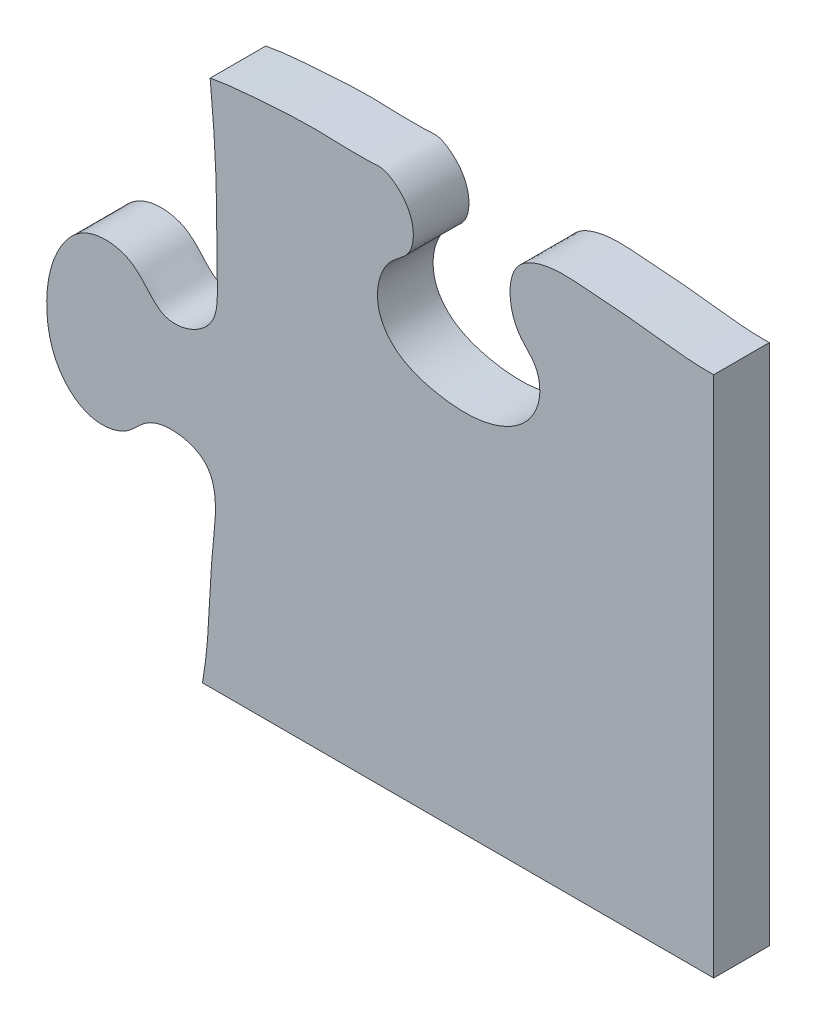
ISO-10303-21;
HEADER;
FILE_DESCRIPTION(('STEP AP214'),'2;1');
FILE_NAME('part.step','',(''),(''),'','','');
FILE_SCHEMA(('AUTOMOTIVE_DESIGN { 1 0 10303 214 1 1 1 1 }'));
ENDSEC;
DATA;
#1=APPLICATION_CONTEXT('core data for automotive mechanical design processes');
#2=APPLICATION_PROTOCOL_DEFINITION('international standard','automotive_design',2000,#1);
#3=PRODUCT_CONTEXT('',#1,'mechanical');
#4=PRODUCT('Part','Part','',(#3));
#5=PRODUCT_RELATED_PRODUCT_CATEGORY('part','',(#4));
#6=PRODUCT_DEFINITION_FORMATION('','',#4);
#7=PRODUCT_DEFINITION_CONTEXT('part definition',#1,'design');
#8=PRODUCT_DEFINITION('design','',#6,#7);
#9=PRODUCT_DEFINITION_SHAPE('','',#8);
#10=(LENGTH_UNIT() NAMED_UNIT(*) SI_UNIT(.MILLI.,.METRE.));
#11=(NAMED_UNIT(*) PLANE_ANGLE_UNIT() SI_UNIT($,.RADIAN.));
#12=(NAMED_UNIT(*) SI_UNIT($,.STERADIAN.) SOLID_ANGLE_UNIT());
#13=UNCERTAINTY_MEASURE_WITH_UNIT(LENGTH_MEASURE(1.E-05),#10,'distance_accuracy_value','');
#14=(GEOMETRIC_REPRESENTATION_CONTEXT(3) GLOBAL_UNCERTAINTY_ASSIGNED_CONTEXT((#13)) GLOBAL_UNIT_ASSIGNED_CONTEXT((#10,
#11,#12)) REPRESENTATION_CONTEXT('',''));
#15=CARTESIAN_POINT('',(0.,0.,0.));
#16=DIRECTION('',(0.,0.,1.));
#17=DIRECTION('',(1.,0.,0.));
#18=AXIS2_PLACEMENT_3D('',#15,#16,#17);
#19=CARTESIAN_POINT('',(325.257058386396,356.,-0.00999999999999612));
#20=CARTESIAN_POINT('',(320.961162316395,345.029410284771,-0.00999999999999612));
#21=CARTESIAN_POINT('',(320.821863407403,330.111228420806,-0.00999999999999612));
#22=CARTESIAN_POINT('',(317.746642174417,310.708405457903,-0.00999999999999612));
#23=CARTESIAN_POINT('',(324.80874526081,302.068845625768,-0.00999999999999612));
#24=CARTESIAN_POINT('',(334.47949844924,301.092198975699,-0.00999999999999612));
#25=CARTESIAN_POINT('',(341.199385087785,308.405018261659,-0.00999999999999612));
#26=CARTESIAN_POINT('',(351.88918877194,310.104343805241,-0.00999999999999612));
#27=CARTESIAN_POINT('',(365.477229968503,308.551893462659,-0.00999999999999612));
#28=CARTESIAN_POINT('',(373.973100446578,293.452904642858,-0.00999999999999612));
#29=CARTESIAN_POINT('',(374.68177629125,275.222888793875,-0.00999999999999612));
#30=CARTESIAN_POINT('',(363.969524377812,260.217712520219,-0.00999999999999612));
#31=CARTESIAN_POINT('',(347.560929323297,258.00994019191,-0.00999999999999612));
#32=CARTESIAN_POINT('',(341.667769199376,269.318092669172,-0.00999999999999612));
#33=CARTESIAN_POINT('',(329.050646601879,268.591464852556,-0.00999999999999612));
#34=CARTESIAN_POINT('',(320.333215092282,258.695380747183,-0.00999999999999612));
#35=CARTESIAN_POINT('',(321.071783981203,237.536716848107,-0.00999999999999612));
#36=CARTESIAN_POINT('',(324.445641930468,214.63289279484,-0.00999999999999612));
#37=CARTESIAN_POINT('',(329.382935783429,185.164436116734,-0.00999999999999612));
#38=CARTESIAN_POINT('',(327.148862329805,151.381238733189,-0.00999999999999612));
#39=CARTESIAN_POINT('',(325.104399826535,122.782989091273,-0.00999999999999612));
#40=CARTESIAN_POINT('',(327.870971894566,95.9027200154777,-0.00999999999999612));
#41=CARTESIAN_POINT('',(342.142457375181,93.3383677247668,-0.00999999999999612));
#42=CARTESIAN_POINT('',(347.900573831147,101.981576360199,-0.00999999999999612));
#43=CARTESIAN_POINT('',(356.834615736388,107.765098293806,-0.00999999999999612));
#44=CARTESIAN_POINT('',(369.379527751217,108.600772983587,-0.00999999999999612));
#45=CARTESIAN_POINT('',(380.120269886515,95.9775166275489,-0.00999999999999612));
#46=CARTESIAN_POINT('',(380.578851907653,78.7451628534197,-0.00999999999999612));
#47=CARTESIAN_POINT('',(375.610818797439,61.7248962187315,-0.00999999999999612));
#48=CARTESIAN_POINT('',(363.715824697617,52.8157722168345,-0.00999999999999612));
#49=CARTESIAN_POINT('',(349.85984979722,55.1705340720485,-0.00999999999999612));
#50=CARTESIAN_POINT('',(346.945856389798,64.810819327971,-0.00999999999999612));
#51=CARTESIAN_POINT('',(338.689797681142,70.9897723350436,-0.00999999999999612));
#52=CARTESIAN_POINT('',(330.580353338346,62.4728514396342,-0.00999999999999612));
#53=CARTESIAN_POINT('',(328.928359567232,48.4436203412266,-0.00999999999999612));
#54=CARTESIAN_POINT('',(329.318852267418,30.6791591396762,-0.00999999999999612));
#55=CARTESIAN_POINT('',(330.266196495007,6.75725364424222,-0.00999999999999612));
#56=CARTESIAN_POINT('',(328.413221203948,-22.8156731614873,-0.00999999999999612));
#57=CARTESIAN_POINT('',(325.957403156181,-47.4645191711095,-0.00999999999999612));
#58=CARTESIAN_POINT('',(324.284943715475,-71.7282942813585,-0.00999999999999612));
#59=CARTESIAN_POINT('',(336.158184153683,-74.5800053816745,-0.00999999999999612));
#60=CARTESIAN_POINT('',(345.605596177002,-70.2479425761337,-0.00999999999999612));
#61=CARTESIAN_POINT('',(352.349142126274,-60.6528291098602,-0.00999999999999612));
#62=CARTESIAN_POINT('',(364.054661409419,-61.084248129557,-0.00999999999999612));
#63=CARTESIAN_POINT('',(376.894401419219,-65.7171784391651,-0.00999999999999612));
#64=CARTESIAN_POINT('',(383.833690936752,-81.7570856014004,-0.00999999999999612));
#65=CARTESIAN_POINT('',(380.385627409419,-99.5380411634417,-0.00999999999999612));
#66=CARTESIAN_POINT('',(369.163029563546,-108.064440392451,-0.00999999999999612));
#67=CARTESIAN_POINT('',(355.487733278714,-112.894616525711,-0.00999999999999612));
#68=CARTESIAN_POINT('',(345.56890588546,-106.804716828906,-0.00999999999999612));
#69=CARTESIAN_POINT('',(337.864154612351,-99.6791187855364,-0.00999999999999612));
#70=CARTESIAN_POINT('',(325.333875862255,-101.340144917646,-0.00999999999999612));
#71=CARTESIAN_POINT('',(326.442256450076,-127.027418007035,-0.00999999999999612));
#72=CARTESIAN_POINT('',(328.990782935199,-147.650339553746,-0.00999999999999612));
#73=CARTESIAN_POINT('',(331.889209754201,-175.720931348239,-0.00999999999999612));
#74=CARTESIAN_POINT('',(333.49389611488,-200.043501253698,-0.00999999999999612));
#75=CARTESIAN_POINT('',(333.062418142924,-222.75850264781,-0.00999999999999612));
#76=CARTESIAN_POINT('',(334.041200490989,-241.335918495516,-0.00999999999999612));
#77=CARTESIAN_POINT('',(324.292862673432,-248.82670983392,-0.00999999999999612));
#78=CARTESIAN_POINT('',(313.862264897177,-249.831348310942,-0.00999999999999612));
#79=CARTESIAN_POINT('',(308.055191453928,-242.821422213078,-0.00999999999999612));
#80=CARTESIAN_POINT('',(300.480173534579,-235.015509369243,-0.00999999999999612));
#81=CARTESIAN_POINT('',(285.021810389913,-234.387092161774,-0.00999999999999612));
#82=CARTESIAN_POINT('',(274.179995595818,-248.432983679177,-0.00999999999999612));
#83=CARTESIAN_POINT('',(270.871780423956,-265.971502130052,-0.00999999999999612));
#84=CARTESIAN_POINT('',(274.212392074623,-284.032454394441,-0.00999999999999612));
#85=CARTESIAN_POINT('',(287.225269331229,-295.05235393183,-0.00999999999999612));
#86=CARTESIAN_POINT('',(300.809811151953,-292.931473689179,-0.00999999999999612));
#87=CARTESIAN_POINT('',(307.364923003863,-284.321305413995,-0.00999999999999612));
#88=CARTESIAN_POINT('',(317.634904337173,-281.646810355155,-0.00999999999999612));
#89=CARTESIAN_POINT('',(335.194502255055,-286.515768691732,-0.00999999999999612));
#90=CARTESIAN_POINT('',(329.900008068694,-321.054322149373,-0.00999999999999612));
#91=CARTESIAN_POINT('',(330.939416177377,-339.80390498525,-0.00999999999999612));
#92=CARTESIAN_POINT('',(328.124742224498,-356.,-0.00999999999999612));
#93=B_SPLINE_CURVE_WITH_KNOTS('',3,(#19,#20,#21,#22,#23,#24,#25,#26,#27,#28,#29,#30,#31,#32,#33,
#34,#35,#36,#37,#38,#39,#40,#41,#42,#43,#44,#45,#46,#47,#48,#49,#50,#51,#52,#53,#54,#55,#56,#57,
#58,#59,#60,#61,#62,#63,#64,#65,#66,#67,#68,#69,#70,#71,#72,#73,#74,#75,#76,#77,#78,#79,#80,#81,
#82,#83,#84,#85,#86,#87,#88,#89,#90,#91,#92),.UNSPECIFIED.,.F.,.F.,(4,1,1,1,1,1,1,1,1,1,1,1,1,1,
1,1,1,1,1,1,1,1,1,1,1,1,1,1,1,1,1,1,1,1,1,1,1,1,1,1,1,1,1,1,1,1,1,1,1,1,1,1,1,1,1,1,1,1,1,1,1,1,
1,1,1,1,1,1,1,1,1,4),(0.,0.0294359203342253,0.0410015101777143,0.0482578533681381,
0.056156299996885,0.0628725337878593,0.0726761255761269,0.0834491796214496,0.0961628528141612,
0.113582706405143,0.1292026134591,0.140393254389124,0.149299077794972,0.1578234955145,
0.168702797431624,0.18034067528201,0.211171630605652,0.230177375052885,0.258218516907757,
0.297936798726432,0.310855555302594,0.319545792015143,0.327782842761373,0.335750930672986,
0.347377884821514,0.35651553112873,0.375682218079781,0.389966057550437,0.401463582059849,
0.411615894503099,0.420595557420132,0.426581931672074,0.43417370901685,0.444880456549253,
0.464136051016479,0.480140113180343,0.507902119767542,0.539252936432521,0.552990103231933,
0.558383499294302,0.567729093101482,0.578921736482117,0.586248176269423,0.596305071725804,
0.613504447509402,0.626237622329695,0.64117705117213,0.647978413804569,0.662971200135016,
0.667795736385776,0.675224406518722,0.689293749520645,0.721613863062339,0.73643728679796,
0.762019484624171,0.785031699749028,0.797726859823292,0.806664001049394,0.814473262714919,
0.822386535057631,0.828765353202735,0.842978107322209,0.855573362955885,0.871677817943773,
0.889062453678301,0.900888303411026,0.912516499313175,0.920249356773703,0.928039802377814,
0.939164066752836,0.961164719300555,1.),.UNSPECIFIED.);
#94=DIRECTION('',(0.,0.,1.));
#95=VECTOR('',#94,1.);
#96=SURFACE_OF_LINEAR_EXTRUSION('',#93,#95);
#97=CARTESIAN_POINT('',(325.257058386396,356.,20.));
#98=CARTESIAN_POINT('',(320.961162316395,345.029410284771,20.));
#99=CARTESIAN_POINT('',(320.821863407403,330.111228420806,20.));
#100=CARTESIAN_POINT('',(317.746642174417,310.708405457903,20.));
#101=CARTESIAN_POINT('',(324.80874526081,302.068845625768,20.));
#102=CARTESIAN_POINT('',(334.47949844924,301.092198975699,20.));
#103=CARTESIAN_POINT('',(341.199385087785,308.405018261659,20.));
#104=CARTESIAN_POINT('',(351.88918877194,310.104343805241,20.));
#105=CARTESIAN_POINT('',(365.477229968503,308.551893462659,20.));
#106=CARTESIAN_POINT('',(373.973100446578,293.452904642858,20.));
#107=CARTESIAN_POINT('',(374.68177629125,275.222888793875,20.));
#108=CARTESIAN_POINT('',(363.969524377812,260.217712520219,20.));
#109=CARTESIAN_POINT('',(347.560929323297,258.00994019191,20.));
#110=CARTESIAN_POINT('',(341.667769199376,269.318092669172,20.));
#111=CARTESIAN_POINT('',(329.050646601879,268.591464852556,20.));
#112=CARTESIAN_POINT('',(320.333215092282,258.695380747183,20.));
#113=CARTESIAN_POINT('',(321.071783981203,237.536716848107,20.));
#114=CARTESIAN_POINT('',(324.445641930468,214.63289279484,20.));
#115=CARTESIAN_POINT('',(329.382935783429,185.164436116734,20.));
#116=CARTESIAN_POINT('',(327.148862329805,151.381238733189,20.));
#117=CARTESIAN_POINT('',(325.104399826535,122.782989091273,20.));
#118=CARTESIAN_POINT('',(327.870971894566,95.9027200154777,20.));
#119=CARTESIAN_POINT('',(342.142457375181,93.3383677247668,20.));
#120=CARTESIAN_POINT('',(347.900573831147,101.981576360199,20.));
#121=CARTESIAN_POINT('',(356.834615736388,107.765098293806,20.));
#122=CARTESIAN_POINT('',(369.379527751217,108.600772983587,20.));
#123=CARTESIAN_POINT('',(380.120269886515,95.9775166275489,20.));
#124=CARTESIAN_POINT('',(380.578851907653,78.7451628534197,20.));
#125=CARTESIAN_POINT('',(375.610818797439,61.7248962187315,20.));
#126=CARTESIAN_POINT('',(363.715824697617,52.8157722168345,20.));
#127=CARTESIAN_POINT('',(349.85984979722,55.1705340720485,20.));
#128=CARTESIAN_POINT('',(346.945856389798,64.810819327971,20.));
#129=CARTESIAN_POINT('',(338.689797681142,70.9897723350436,20.));
#130=CARTESIAN_POINT('',(330.580353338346,62.4728514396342,20.));
#131=CARTESIAN_POINT('',(328.928359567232,48.4436203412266,20.));
#132=CARTESIAN_POINT('',(329.318852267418,30.6791591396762,20.));
#133=CARTESIAN_POINT('',(330.266196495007,6.75725364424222,20.));
#134=CARTESIAN_POINT('',(328.413221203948,-22.8156731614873,20.));
#135=CARTESIAN_POINT('',(325.957403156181,-47.4645191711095,20.));
#136=CARTESIAN_POINT('',(324.284943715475,-71.7282942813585,20.));
#137=CARTESIAN_POINT('',(336.158184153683,-74.5800053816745,20.));
#138=CARTESIAN_POINT('',(345.605596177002,-70.2479425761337,20.));
#139=CARTESIAN_POINT('',(352.349142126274,-60.6528291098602,20.));
#140=CARTESIAN_POINT('',(364.054661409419,-61.084248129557,20.));
#141=CARTESIAN_POINT('',(376.894401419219,-65.7171784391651,20.));
#142=CARTESIAN_POINT('',(383.833690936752,-81.7570856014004,20.));
#143=CARTESIAN_POINT('',(380.385627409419,-99.5380411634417,20.));
#144=CARTESIAN_POINT('',(369.163029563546,-108.064440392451,20.));
#145=CARTESIAN_POINT('',(355.487733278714,-112.894616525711,20.));
#146=CARTESIAN_POINT('',(345.56890588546,-106.804716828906,20.));
#147=CARTESIAN_POINT('',(337.864154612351,-99.6791187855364,20.));
#148=CARTESIAN_POINT('',(325.333875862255,-101.340144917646,20.));
#149=CARTESIAN_POINT('',(326.442256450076,-127.027418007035,20.));
#150=CARTESIAN_POINT('',(328.990782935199,-147.650339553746,20.));
#151=CARTESIAN_POINT('',(331.889209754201,-175.720931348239,20.));
#152=CARTESIAN_POINT('',(333.49389611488,-200.043501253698,20.));
#153=CARTESIAN_POINT('',(333.062418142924,-222.75850264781,20.));
#154=CARTESIAN_POINT('',(334.041200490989,-241.335918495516,20.));
#155=CARTESIAN_POINT('',(324.292862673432,-248.82670983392,20.));
#156=CARTESIAN_POINT('',(313.862264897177,-249.831348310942,20.));
#157=CARTESIAN_POINT('',(308.055191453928,-242.821422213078,20.));
#158=CARTESIAN_POINT('',(300.480173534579,-235.015509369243,20.));
#159=CARTESIAN_POINT('',(285.021810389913,-234.387092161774,20.));
#160=CARTESIAN_POINT('',(274.179995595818,-248.432983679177,20.));
#161=CARTESIAN_POINT('',(270.871780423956,-265.971502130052,20.));
#162=CARTESIAN_POINT('',(274.212392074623,-284.032454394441,20.));
#163=CARTESIAN_POINT('',(287.225269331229,-295.05235393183,20.));
#164=CARTESIAN_POINT('',(300.809811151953,-292.931473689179,20.));
#165=CARTESIAN_POINT('',(307.364923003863,-284.321305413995,20.));
#166=CARTESIAN_POINT('',(317.634904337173,-281.646810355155,20.));
#167=CARTESIAN_POINT('',(335.194502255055,-286.515768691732,20.));
#168=CARTESIAN_POINT('',(329.900008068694,-321.054322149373,20.));
#169=CARTESIAN_POINT('',(330.939416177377,-339.80390498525,20.));
#170=CARTESIAN_POINT('',(328.124742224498,-356.,20.));
#171=B_SPLINE_CURVE_WITH_KNOTS('',3,(#97,#98,#99,#100,#101,#102,#103,#104,#105,#106,#107,#108,
#109,#110,#111,#112,#113,#114,#115,#116,#117,#118,#119,#120,#121,#122,#123,#124,#125,#126,#127,
#128,#129,#130,#131,#132,#133,#134,#135,#136,#137,#138,#139,#140,#141,#142,#143,#144,#145,#146,
#147,#148,#149,#150,#151,#152,#153,#154,#155,#156,#157,#158,#159,#160,#161,#162,#163,#164,#165,
#166,#167,#168,#169,#170),.UNSPECIFIED.,.F.,.F.,(4,1,1,1,1,1,1,1,1,1,1,1,1,1,1,1,1,1,1,1,1,1,1,
1,1,1,1,1,1,1,1,1,1,1,1,1,1,1,1,1,1,1,1,1,1,1,1,1,1,1,1,1,1,1,1,1,1,1,1,1,1,1,1,1,1,1,1,1,1,1,1,
4),(0.,0.0294359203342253,0.0410015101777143,0.0482578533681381,0.056156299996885,
0.0628725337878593,0.0726761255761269,0.0834491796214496,0.0961628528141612,0.113582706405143,
0.1292026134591,0.140393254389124,0.149299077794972,0.1578234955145,0.168702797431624,
0.18034067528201,0.211171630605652,0.230177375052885,0.258218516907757,0.297936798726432,
0.310855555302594,0.319545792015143,0.327782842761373,0.335750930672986,0.347377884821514,
0.35651553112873,0.375682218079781,0.389966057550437,0.401463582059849,0.411615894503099,
0.420595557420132,0.426581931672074,0.43417370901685,0.444880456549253,0.464136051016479,
0.480140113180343,0.507902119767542,0.539252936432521,0.552990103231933,0.558383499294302,
0.567729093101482,0.578921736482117,0.586248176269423,0.596305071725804,0.613504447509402,
0.626237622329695,0.64117705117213,0.647978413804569,0.662971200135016,0.667795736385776,
0.675224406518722,0.689293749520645,0.721613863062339,0.73643728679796,0.762019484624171,
0.785031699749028,0.797726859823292,0.806664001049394,0.814473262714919,0.822386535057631,
0.828765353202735,0.842978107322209,0.855573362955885,0.871677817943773,0.889062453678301,
0.900888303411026,0.912516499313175,0.920249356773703,0.928039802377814,0.939164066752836,
0.961164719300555,1.),.UNSPECIFIED.);
#172=CARTESIAN_POINT('',(330.882415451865,-166.22555796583,20.));
#173=VERTEX_POINT('',#172);
#174=CARTESIAN_POINT('',(328.124742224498,-356.,20.));
#175=VERTEX_POINT('',#174);
#176=EDGE_CURVE('E86',#173,#175,#171,.T.);
#177=ORIENTED_EDGE('',*,*,#176,.F.);
#178=DIRECTION('',(0.,0.,1.));
#179=VECTOR('',#178,1.);
#180=CARTESIAN_POINT('',(330.88241545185,-166.225557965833,-0.00999999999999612));
#181=LINE('',#180,#179);
#182=CARTESIAN_POINT('',(330.882415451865,-166.22555796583,0.));
#183=VERTEX_POINT('',#182);
#184=EDGE_CURVE('E78',#173,#183,#181,.F.);
#185=ORIENTED_EDGE('',*,*,#184,.T.);
#186=CARTESIAN_POINT('',(325.257058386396,356.,0.));
#187=CARTESIAN_POINT('',(320.961162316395,345.029410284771,0.));
#188=CARTESIAN_POINT('',(320.821863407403,330.111228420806,0.));
#189=CARTESIAN_POINT('',(317.746642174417,310.708405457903,0.));
#190=CARTESIAN_POINT('',(324.80874526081,302.068845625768,0.));
#191=CARTESIAN_POINT('',(334.47949844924,301.092198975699,0.));
#192=CARTESIAN_POINT('',(341.199385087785,308.405018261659,0.));
#193=CARTESIAN_POINT('',(351.88918877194,310.104343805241,0.));
#194=CARTESIAN_POINT('',(365.477229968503,308.551893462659,0.));
#195=CARTESIAN_POINT('',(373.973100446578,293.452904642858,0.));
#196=CARTESIAN_POINT('',(374.68177629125,275.222888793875,0.));
#197=CARTESIAN_POINT('',(363.969524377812,260.217712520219,0.));
#198=CARTESIAN_POINT('',(347.560929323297,258.00994019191,0.));
#199=CARTESIAN_POINT('',(341.667769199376,269.318092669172,0.));
#200=CARTESIAN_POINT('',(329.050646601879,268.591464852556,0.));
#201=CARTESIAN_POINT('',(320.333215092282,258.695380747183,0.));
#202=CARTESIAN_POINT('',(321.071783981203,237.536716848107,0.));
#203=CARTESIAN_POINT('',(324.445641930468,214.63289279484,0.));
#204=CARTESIAN_POINT('',(329.382935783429,185.164436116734,0.));
#205=CARTESIAN_POINT('',(327.148862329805,151.381238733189,0.));
#206=CARTESIAN_POINT('',(325.104399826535,122.782989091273,0.));
#207=CARTESIAN_POINT('',(327.870971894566,95.9027200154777,0.));
#208=CARTESIAN_POINT('',(342.142457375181,93.3383677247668,0.));
#209=CARTESIAN_POINT('',(347.900573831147,101.981576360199,0.));
#210=CARTESIAN_POINT('',(356.834615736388,107.765098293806,0.));
#211=CARTESIAN_POINT('',(369.379527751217,108.600772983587,0.));
#212=CARTESIAN_POINT('',(380.120269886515,95.9775166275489,0.));
#213=CARTESIAN_POINT('',(380.578851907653,78.7451628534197,0.));
#214=CARTESIAN_POINT('',(375.610818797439,61.7248962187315,0.));
#215=CARTESIAN_POINT('',(363.715824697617,52.8157722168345,0.));
#216=CARTESIAN_POINT('',(349.85984979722,55.1705340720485,0.));
#217=CARTESIAN_POINT('',(346.945856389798,64.810819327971,0.));
#218=CARTESIAN_POINT('',(338.689797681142,70.9897723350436,0.));
#219=CARTESIAN_POINT('',(330.580353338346,62.4728514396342,0.));
#220=CARTESIAN_POINT('',(328.928359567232,48.4436203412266,0.));
#221=CARTESIAN_POINT('',(329.318852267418,30.6791591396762,0.));
#222=CARTESIAN_POINT('',(330.266196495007,6.75725364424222,0.));
#223=CARTESIAN_POINT('',(328.413221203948,-22.8156731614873,0.));
#224=CARTESIAN_POINT('',(325.957403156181,-47.4645191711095,0.));
#225=CARTESIAN_POINT('',(324.284943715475,-71.7282942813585,0.));
#226=CARTESIAN_POINT('',(336.158184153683,-74.5800053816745,0.));
#227=CARTESIAN_POINT('',(345.605596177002,-70.2479425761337,0.));
#228=CARTESIAN_POINT('',(352.349142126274,-60.6528291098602,0.));
#229=CARTESIAN_POINT('',(364.054661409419,-61.084248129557,0.));
#230=CARTESIAN_POINT('',(376.894401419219,-65.7171784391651,0.));
#231=CARTESIAN_POINT('',(383.833690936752,-81.7570856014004,0.));
#232=CARTESIAN_POINT('',(380.385627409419,-99.5380411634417,0.));
#233=CARTESIAN_POINT('',(369.163029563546,-108.064440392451,0.));
#234=CARTESIAN_POINT('',(355.487733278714,-112.894616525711,0.));
#235=CARTESIAN_POINT('',(345.56890588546,-106.804716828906,0.));
#236=CARTESIAN_POINT('',(337.864154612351,-99.6791187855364,0.));
#237=CARTESIAN_POINT('',(325.333875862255,-101.340144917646,0.));
#238=CARTESIAN_POINT('',(326.442256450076,-127.027418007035,0.));
#239=CARTESIAN_POINT('',(328.990782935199,-147.650339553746,0.));
#240=CARTESIAN_POINT('',(331.889209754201,-175.720931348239,0.));
#241=CARTESIAN_POINT('',(333.49389611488,-200.043501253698,0.));
#242=CARTESIAN_POINT('',(333.062418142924,-222.75850264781,0.));
#243=CARTESIAN_POINT('',(334.041200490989,-241.335918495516,0.));
#244=CARTESIAN_POINT('',(324.292862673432,-248.82670983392,0.));
#245=CARTESIAN_POINT('',(313.862264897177,-249.831348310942,0.));
#246=CARTESIAN_POINT('',(308.055191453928,-242.821422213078,0.));
#247=CARTESIAN_POINT('',(300.480173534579,-235.015509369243,0.));
#248=CARTESIAN_POINT('',(285.021810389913,-234.387092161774,0.));
#249=CARTESIAN_POINT('',(274.179995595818,-248.432983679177,0.));
#250=CARTESIAN_POINT('',(270.871780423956,-265.971502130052,0.));
#251=CARTESIAN_POINT('',(274.212392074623,-284.032454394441,0.));
#252=CARTESIAN_POINT('',(287.225269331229,-295.05235393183,0.));
#253=CARTESIAN_POINT('',(300.809811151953,-292.931473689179,0.));
#254=CARTESIAN_POINT('',(307.364923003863,-284.321305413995,0.));
#255=CARTESIAN_POINT('',(317.634904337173,-281.646810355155,0.));
#256=CARTESIAN_POINT('',(335.194502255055,-286.515768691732,0.));
#257=CARTESIAN_POINT('',(329.900008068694,-321.054322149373,0.));
#258=CARTESIAN_POINT('',(330.939416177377,-339.80390498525,0.));
#259=CARTESIAN_POINT('',(328.124742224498,-356.,0.));
#260=B_SPLINE_CURVE_WITH_KNOTS('',3,(#186,#187,#188,#189,#190,#191,#192,#193,#194,#195,#196,
#197,#198,#199,#200,#201,#202,#203,#204,#205,#206,#207,#208,#209,#210,#211,#212,#213,#214,#215,
#216,#217,#218,#219,#220,#221,#222,#223,#224,#225,#226,#227,#228,#229,#230,#231,#232,#233,#234,
#235,#236,#237,#238,#239,#240,#241,#242,#243,#244,#245,#246,#247,#248,#249,#250,#251,#252,#253,
#254,#255,#256,#257,#258,#259),.UNSPECIFIED.,.F.,.F.,(4,1,1,1,1,1,1,1,1,1,1,1,1,1,1,1,1,1,1,1,1,
1,1,1,1,1,1,1,1,1,1,1,1,1,1,1,1,1,1,1,1,1,1,1,1,1,1,1,1,1,1,1,1,1,1,1,1,1,1,1,1,1,1,1,1,1,1,1,1,
1,1,4),(0.,0.0294359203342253,0.0410015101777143,0.0482578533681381,0.056156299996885,
0.0628725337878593,0.0726761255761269,0.0834491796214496,0.0961628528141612,0.113582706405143,
0.1292026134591,0.140393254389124,0.149299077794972,0.1578234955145,0.168702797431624,
0.18034067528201,0.211171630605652,0.230177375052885,0.258218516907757,0.297936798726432,
0.310855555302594,0.319545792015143,0.327782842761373,0.335750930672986,0.347377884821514,
0.35651553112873,0.375682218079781,0.389966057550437,0.401463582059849,0.411615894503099,
0.420595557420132,0.426581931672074,0.43417370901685,0.444880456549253,0.464136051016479,
0.480140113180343,0.507902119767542,0.539252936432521,0.552990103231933,0.558383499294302,
0.567729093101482,0.578921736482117,0.586248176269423,0.596305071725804,0.613504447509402,
0.626237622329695,0.64117705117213,0.647978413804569,0.662971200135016,0.667795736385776,
0.675224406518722,0.689293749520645,0.721613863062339,0.73643728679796,0.762019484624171,
0.785031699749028,0.797726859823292,0.806664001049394,0.814473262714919,0.822386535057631,
0.828765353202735,0.842978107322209,0.855573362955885,0.871677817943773,0.889062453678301,
0.900888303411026,0.912516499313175,0.920249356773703,0.928039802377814,0.939164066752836,
0.961164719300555,1.),.UNSPECIFIED.);
#261=CARTESIAN_POINT('',(328.124742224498,-356.,0.));
#262=VERTEX_POINT('',#261);
#263=EDGE_CURVE('E85',#183,#262,#260,.T.);
#264=ORIENTED_EDGE('',*,*,#263,.T.);
#265=DIRECTION('',(0.,0.,1.));
#266=VECTOR('',#265,1.);
#267=CARTESIAN_POINT('',(328.124742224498,-356.,-0.00999999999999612));
#268=LINE('',#267,#266);
#269=EDGE_CURVE('E87',#262,#175,#268,.T.);
#270=ORIENTED_EDGE('',*,*,#269,.T.);
#271=EDGE_LOOP('',(#177,#185,#264,#270));
#272=FACE_BOUND('',#271,.T.);
#273=ADVANCED_FACE('F34',(#272),#96,.T.);
#274=CARTESIAN_POINT('',(512.,-356.,20.));
#275=DIRECTION('',(0.,1.,0.));
#276=DIRECTION('',(-1.,0.,0.));
#277=AXIS2_PLACEMENT_3D('',#274,#275,#276);
#278=PLANE('',#277);
#279=ORIENTED_EDGE('',*,*,#269,.F.);
#280=DIRECTION('',(1.,0.,0.));
#281=VECTOR('',#280,1.);
#282=CARTESIAN_POINT('',(512.,-356.,0.));
#283=LINE('',#282,#281);
#284=CARTESIAN_POINT('',(512.,-356.,0.));
#285=VERTEX_POINT('',#284);
#286=EDGE_CURVE('E89',#262,#285,#283,.T.);
#287=ORIENTED_EDGE('',*,*,#286,.T.);
#288=DIRECTION('',(0.,0.,-1.));
#289=VECTOR('',#288,1.);
#290=CARTESIAN_POINT('',(512.,-356.,20.));
#291=LINE('',#290,#289);
#292=CARTESIAN_POINT('',(512.,-356.,20.));
#293=VERTEX_POINT('',#292);
#294=EDGE_CURVE('E80',#293,#285,#291,.T.);
#295=ORIENTED_EDGE('',*,*,#294,.F.);
#296=DIRECTION('',(1.,0.,0.));
#297=VECTOR('',#296,1.);
#298=CARTESIAN_POINT('',(512.,-356.,20.));
#299=LINE('',#298,#297);
#300=EDGE_CURVE('E127',#175,#293,#299,.T.);
#301=ORIENTED_EDGE('',*,*,#300,.F.);
#302=EDGE_LOOP('',(#279,#287,#295,#301));
#303=FACE_BOUND('',#302,.T.);
#304=ADVANCED_FACE('F111',(#303),#278,.F.);
#305=CARTESIAN_POINT('',(512.,-356.,20.));
#306=DIRECTION('',(-1.,0.,0.));
#307=DIRECTION('',(0.,0.,1.));
#308=AXIS2_PLACEMENT_3D('',#305,#306,#307);
#309=PLANE('',#308);
#310=DIRECTION('',(0.,1.,0.));
#311=VECTOR('',#310,1.);
#312=CARTESIAN_POINT('',(512.,-356.,0.));
#313=LINE('',#312,#311);
#314=CARTESIAN_POINT('',(512.,-168.072880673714,0.));
#315=VERTEX_POINT('',#314);
#316=EDGE_CURVE('E133',#285,#315,#313,.T.);
#317=ORIENTED_EDGE('',*,*,#316,.T.);
#318=DIRECTION('',(0.,0.,1.));
#319=VECTOR('',#318,1.);
#320=CARTESIAN_POINT('',(512.,-168.072880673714,-0.00999999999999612));
#321=LINE('',#320,#319);
#322=CARTESIAN_POINT('',(512.,-168.072880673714,20.));
#323=VERTEX_POINT('',#322);
#324=EDGE_CURVE('E45',#315,#323,#321,.T.);
#325=ORIENTED_EDGE('',*,*,#324,.T.);
#326=DIRECTION('',(0.,1.,0.));
#327=VECTOR('',#326,1.);
#328=CARTESIAN_POINT('',(512.,-356.,20.));
#329=LINE('',#328,#327);
#330=EDGE_CURVE('E125',#293,#323,#329,.T.);
#331=ORIENTED_EDGE('',*,*,#330,.F.);
#332=ORIENTED_EDGE('',*,*,#294,.T.);
#333=EDGE_LOOP('',(#317,#325,#331,#332));
#334=FACE_BOUND('',#333,.T.);
#335=ADVANCED_FACE('F113',(#334),#309,.F.);
#336=CARTESIAN_POINT('',(-512.,-172.519287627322,-0.00999999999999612));
#337=CARTESIAN_POINT('',(-502.879283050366,-170.962470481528,-0.00999999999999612));
#338=CARTESIAN_POINT('',(-487.788222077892,-168.37828827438,-0.00999999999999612));
#339=CARTESIAN_POINT('',(-467.037528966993,-166.739801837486,-0.00999999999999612));
#340=CARTESIAN_POINT('',(-454.159365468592,-165.446436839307,-0.00999999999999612));
#341=CARTESIAN_POINT('',(-444.971534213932,-166.107812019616,-0.00999999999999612));
#342=CARTESIAN_POINT('',(-439.850321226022,-171.772015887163,-0.00999999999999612));
#343=CARTESIAN_POINT('',(-440.374957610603,-181.037323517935,-0.00999999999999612));
#344=CARTESIAN_POINT('',(-446.328241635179,-187.391856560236,-0.00999999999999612));
#345=CARTESIAN_POINT('',(-453.905227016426,-194.752671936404,-0.00999999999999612));
#346=CARTESIAN_POINT('',(-453.078389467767,-207.700641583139,-0.00999999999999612));
#347=CARTESIAN_POINT('',(-447.147625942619,-218.930001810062,-0.00999999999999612));
#348=CARTESIAN_POINT('',(-435.337181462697,-224.50074852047,-0.00999999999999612));
#349=CARTESIAN_POINT('',(-423.146614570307,-223.01936726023,-0.00999999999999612));
#350=CARTESIAN_POINT('',(-411.980938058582,-217.277205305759,-0.00999999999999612));
#351=CARTESIAN_POINT('',(-406.065466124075,-206.648631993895,-0.00999999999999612));
#352=CARTESIAN_POINT('',(-404.677696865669,-194.893000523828,-0.00999999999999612));
#353=CARTESIAN_POINT('',(-408.988751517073,-185.080089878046,-0.00999999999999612));
#354=CARTESIAN_POINT('',(-416.250714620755,-179.677092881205,-0.00999999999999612));
#355=CARTESIAN_POINT('',(-414.534960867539,-170.559036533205,-0.00999999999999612));
#356=CARTESIAN_POINT('',(-409.029101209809,-166.771377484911,-0.00999999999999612));
#357=CARTESIAN_POINT('',(-399.765557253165,-166.088529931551,-0.00999999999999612));
#358=CARTESIAN_POINT('',(-387.895154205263,-166.365956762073,-0.00999999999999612));
#359=CARTESIAN_POINT('',(-370.467023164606,-166.815486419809,-0.00999999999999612));
#360=CARTESIAN_POINT('',(-353.468929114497,-167.36046909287,-0.00999999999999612));
#361=CARTESIAN_POINT('',(-335.945481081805,-171.004639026,-0.00999999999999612));
#362=CARTESIAN_POINT('',(-314.642568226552,-174.308910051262,-0.00999999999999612));
#363=CARTESIAN_POINT('',(-295.191530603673,-175.373190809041,-0.00999999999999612));
#364=CARTESIAN_POINT('',(-279.655129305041,-174.532366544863,-0.00999999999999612));
#365=CARTESIAN_POINT('',(-272.871357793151,-169.661223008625,-0.00999999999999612));
#366=CARTESIAN_POINT('',(-269.507556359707,-161.549368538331,-0.00999999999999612));
#367=CARTESIAN_POINT('',(-275.843021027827,-154.65628056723,-0.00999999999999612));
#368=CARTESIAN_POINT('',(-280.95754914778,-144.902856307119,-0.00999999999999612));
#369=CARTESIAN_POINT('',(-276.534312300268,-130.977346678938,-0.00999999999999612));
#370=CARTESIAN_POINT('',(-261.937250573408,-125.579540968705,-0.00999999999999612));
#371=CARTESIAN_POINT('',(-247.663642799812,-124.917748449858,-0.00999999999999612));
#372=CARTESIAN_POINT('',(-234.462562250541,-132.547465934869,-0.00999999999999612));
#373=CARTESIAN_POINT('',(-231.429981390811,-144.191054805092,-0.00999999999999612));
#374=CARTESIAN_POINT('',(-232.066307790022,-154.613730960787,-0.00999999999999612));
#375=CARTESIAN_POINT('',(-238.05545254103,-160.208195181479,-0.00999999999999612));
#376=CARTESIAN_POINT('',(-239.725495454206,-167.504540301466,-0.00999999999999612));
#377=CARTESIAN_POINT('',(-236.616853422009,-176.333406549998,-0.00999999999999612));
#378=CARTESIAN_POINT('',(-223.934770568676,-178.282283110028,-0.00999999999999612));
#379=CARTESIAN_POINT('',(-211.556635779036,-176.87255281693,-0.00999999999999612));
#380=CARTESIAN_POINT('',(-197.283196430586,-172.884179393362,-0.00999999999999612));
#381=CARTESIAN_POINT('',(-182.605892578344,-171.15728588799,-0.00999999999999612));
#382=CARTESIAN_POINT('',(-164.840984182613,-173.659101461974,-0.00999999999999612));
#383=CARTESIAN_POINT('',(-147.945056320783,-175.383809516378,-0.00999999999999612));
#384=CARTESIAN_POINT('',(-131.023155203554,-175.064925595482,-0.00999999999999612));
#385=CARTESIAN_POINT('',(-118.854077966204,-171.888086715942,-0.00999999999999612));
#386=CARTESIAN_POINT('',(-110.251650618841,-164.015375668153,-0.00999999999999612));
#387=CARTESIAN_POINT('',(-112.366058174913,-152.74022327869,-0.00999999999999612));
#388=CARTESIAN_POINT('',(-124.029184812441,-149.21363367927,-0.00999999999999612));
#389=CARTESIAN_POINT('',(-130.728576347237,-135.686086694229,-0.00999999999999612));
#390=CARTESIAN_POINT('',(-127.173489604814,-119.738819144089,-0.00999999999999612));
#391=CARTESIAN_POINT('',(-112.643680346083,-109.612236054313,-0.00999999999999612));
#392=CARTESIAN_POINT('',(-97.8925044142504,-110.264465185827,-0.00999999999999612));
#393=CARTESIAN_POINT('',(-85.3244606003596,-114.886626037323,-0.00999999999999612));
#394=CARTESIAN_POINT('',(-77.7012738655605,-123.996273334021,-0.00999999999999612));
#395=CARTESIAN_POINT('',(-75.1871896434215,-136.082021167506,-0.00999999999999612));
#396=CARTESIAN_POINT('',(-83.4449300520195,-145.685757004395,-0.00999999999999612));
#397=CARTESIAN_POINT('',(-93.6696383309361,-152.57821138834,-0.00999999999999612));
#398=CARTESIAN_POINT('',(-93.6908124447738,-166.777041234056,-0.00999999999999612));
#399=CARTESIAN_POINT('',(-84.1667136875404,-170.982620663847,-0.00999999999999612));
#400=CARTESIAN_POINT('',(-77.6752461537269,-173.278649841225,-0.00999999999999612));
#401=CARTESIAN_POINT('',(-68.1506335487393,-173.35598232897,-0.00999999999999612));
#402=CARTESIAN_POINT('',(-50.9086392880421,-172.467654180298,-0.00999999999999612));
#403=CARTESIAN_POINT('',(-29.3703336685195,-168.255680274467,-0.00999999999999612));
#404=CARTESIAN_POINT('',(-5.85808978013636,-161.016855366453,-0.00999999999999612));
#405=CARTESIAN_POINT('',(10.8279950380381,-157.928962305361,-0.00999999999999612));
#406=CARTESIAN_POINT('',(25.2118575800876,-156.177147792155,-0.00999999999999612));
#407=CARTESIAN_POINT('',(33.2719504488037,-161.887778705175,-0.00999999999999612));
#408=CARTESIAN_POINT('',(35.8385918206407,-171.199049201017,-0.00999999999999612));
#409=CARTESIAN_POINT('',(29.9803253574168,-178.254603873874,-0.00999999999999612));
#410=CARTESIAN_POINT('',(25.4737691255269,-186.687205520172,-0.00999999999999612));
#411=CARTESIAN_POINT('',(28.9610561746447,-203.576557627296,-0.00999999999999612));
#412=CARTESIAN_POINT('',(48.123587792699,-210.569059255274,-0.00999999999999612));
#413=CARTESIAN_POINT('',(64.640055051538,-207.443077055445,-0.00999999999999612));
#414=CARTESIAN_POINT('',(74.3525428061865,-199.315206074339,-0.00999999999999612));
#415=CARTESIAN_POINT('',(75.7823175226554,-188.025012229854,-0.00999999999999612));
#416=CARTESIAN_POINT('',(70.2823025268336,-180.424725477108,-0.00999999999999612));
#417=CARTESIAN_POINT('',(64.0173174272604,-173.04354513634,-0.00999999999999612));
#418=CARTESIAN_POINT('',(71.5185276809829,-158.021609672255,-0.00999999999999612));
#419=CARTESIAN_POINT('',(93.5727320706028,-159.248655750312,-0.00999999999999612));
#420=CARTESIAN_POINT('',(113.740225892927,-158.313305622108,-0.00999999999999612));
#421=CARTESIAN_POINT('',(131.949907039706,-158.592164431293,-0.00999999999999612));
#422=CARTESIAN_POINT('',(148.33531025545,-158.585790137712,-0.00999999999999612));
#423=CARTESIAN_POINT('',(161.926831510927,-159.545351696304,-0.00999999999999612));
#424=CARTESIAN_POINT('',(175.071227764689,-161.773214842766,-0.00999999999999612));
#425=CARTESIAN_POINT('',(191.617950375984,-167.262045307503,-0.00999999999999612));
#426=CARTESIAN_POINT('',(211.099842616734,-169.750201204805,-0.00999999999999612));
#427=CARTESIAN_POINT('',(231.162897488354,-172.887375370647,-0.00999999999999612));
#428=CARTESIAN_POINT('',(248.004345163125,-166.961938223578,-0.00999999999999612));
#429=CARTESIAN_POINT('',(246.8159561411,-153.026737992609,-0.00999999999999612));
#430=CARTESIAN_POINT('',(239.480844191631,-147.244126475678,-0.00999999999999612));
#431=CARTESIAN_POINT('',(236.934105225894,-136.316213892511,-0.00999999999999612));
#432=CARTESIAN_POINT('',(242.714843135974,-119.925321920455,-0.00999999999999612));
#433=CARTESIAN_POINT('',(261.920814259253,-116.243910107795,-0.00999999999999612));
#434=CARTESIAN_POINT('',(276.115384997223,-120.8163533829,-0.00999999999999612));
#435=CARTESIAN_POINT('',(283.920063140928,-128.519918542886,-0.00999999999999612));
#436=CARTESIAN_POINT('',(286.731045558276,-138.27620491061,-0.00999999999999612));
#437=CARTESIAN_POINT('',(285.530131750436,-148.336399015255,-0.00999999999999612));
#438=CARTESIAN_POINT('',(279.231187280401,-154.989394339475,-0.00999999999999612));
#439=CARTESIAN_POINT('',(277.47424541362,-164.19805137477,-0.00999999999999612));
#440=CARTESIAN_POINT('',(282.318065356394,-172.951788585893,-0.00999999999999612));
#441=CARTESIAN_POINT('',(296.661024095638,-174.046241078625,-0.00999999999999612));
#442=CARTESIAN_POINT('',(312.407790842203,-171.220247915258,-0.00999999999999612));
#443=CARTESIAN_POINT('',(331.258502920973,-165.499354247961,-0.00999999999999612));
#444=CARTESIAN_POINT('',(349.515462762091,-164.109048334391,-0.00999999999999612));
#445=CARTESIAN_POINT('',(369.065560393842,-162.668121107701,-0.00999999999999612));
#446=CARTESIAN_POINT('',(383.300131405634,-163.956688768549,-0.00999999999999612));
#447=CARTESIAN_POINT('',(393.167029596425,-163.158367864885,-0.00999999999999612));
#448=CARTESIAN_POINT('',(398.987630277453,-166.389896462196,-0.00999999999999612));
#449=CARTESIAN_POINT('',(404.84494808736,-173.902135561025,-0.00999999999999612));
#450=CARTESIAN_POINT('',(403.877710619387,-184.83720633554,-0.00999999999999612));
#451=CARTESIAN_POINT('',(397.972595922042,-188.779997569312,-0.00999999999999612));
#452=CARTESIAN_POINT('',(391.418741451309,-195.180814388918,-0.00999999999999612));
#453=CARTESIAN_POINT('',(389.486866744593,-207.78576343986,-0.00999999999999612));
#454=CARTESIAN_POINT('',(398.568510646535,-219.719050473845,-0.00999999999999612));
#455=CARTESIAN_POINT('',(413.367098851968,-224.627522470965,-0.00999999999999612));
#456=CARTESIAN_POINT('',(430.645527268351,-225.349016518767,-0.00999999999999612));
#457=CARTESIAN_POINT('',(445.119633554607,-217.990655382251,-0.00999999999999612));
#458=CARTESIAN_POINT('',(450.39877091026,-206.645471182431,-0.00999999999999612));
#459=CARTESIAN_POINT('',(448.623596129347,-196.883477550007,-0.00999999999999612));
#460=CARTESIAN_POINT('',(441.485570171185,-190.93342380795,-0.00999999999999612));
#461=CARTESIAN_POINT('',(437.838155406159,-181.169971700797,-0.00999999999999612));
#462=CARTESIAN_POINT('',(439.616707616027,-168.611761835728,-0.00999999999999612));
#463=CARTESIAN_POINT('',(452.865547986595,-163.032695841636,-0.00999999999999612));
#464=CARTESIAN_POINT('',(467.117395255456,-164.448128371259,-0.00999999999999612));
#465=CARTESIAN_POINT('',(487.604647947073,-165.665160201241,-0.00999999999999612));
#466=CARTESIAN_POINT('',(502.403051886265,-168.291679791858,-0.00999999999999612));
#467=CARTESIAN_POINT('',(512.,-168.072880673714,-0.00999999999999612));
#468=B_SPLINE_CURVE_WITH_KNOTS('',3,(#336,#337,#338,#339,#340,#341,#342,#343,#344,#345,#346,
#347,#348,#349,#350,#351,#352,#353,#354,#355,#356,#357,#358,#359,#360,#361,#362,#363,#364,#365,
#366,#367,#368,#369,#370,#371,#372,#373,#374,#375,#376,#377,#378,#379,#380,#381,#382,#383,#384,
#385,#386,#387,#388,#389,#390,#391,#392,#393,#394,#395,#396,#397,#398,#399,#400,#401,#402,#403,
#404,#405,#406,#407,#408,#409,#410,#411,#412,#413,#414,#415,#416,#417,#418,#419,#420,#421,#422,
#423,#424,#425,#426,#427,#428,#429,#430,#431,#432,#433,#434,#435,#436,#437,#438,#439,#440,#441,
#442,#443,#444,#445,#446,#447,#448,#449,#450,#451,#452,#453,#454,#455,#456,#457,#458,#459,#460,
#461,#462,#463,#464,#465,#466,#467),.UNSPECIFIED.,.F.,.F.,(4,1,1,1,1,1,1,1,1,1,1,1,1,1,1,1,1,1,
1,1,1,1,1,1,1,1,1,1,1,1,1,1,1,1,1,1,1,1,1,1,1,1,1,1,1,1,1,1,1,1,1,1,1,1,1,1,1,1,1,1,1,1,1,1,1,1,
1,1,1,1,1,1,1,1,1,1,1,1,1,1,1,1,1,1,1,1,1,1,1,1,1,1,1,1,1,1,1,1,1,1,1,1,1,1,1,1,1,1,1,1,1,1,1,1,
1,1,1,1,1,1,1,1,1,1,1,1,1,1,1,4),(0.,0.0165769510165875,0.0274671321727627,0.0371464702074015,
0.0400980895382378,0.0433463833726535,0.0497073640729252,0.0544453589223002,0.0588139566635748,
0.0681101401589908,0.0747959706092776,0.0809546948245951,0.0901532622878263,0.095867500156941,
0.102811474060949,0.111015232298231,0.116106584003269,0.121579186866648,0.125543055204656,
0.130677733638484,0.132270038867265,0.141466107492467,0.152619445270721,0.163261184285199,
0.17192085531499,0.184637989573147,0.201793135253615,0.207148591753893,0.211794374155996,
0.216266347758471,0.220719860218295,0.227137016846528,0.235715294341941,0.242716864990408,
0.253632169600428,0.260665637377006,0.267939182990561,0.274072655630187,0.278241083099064,
0.281904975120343,0.287053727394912,0.29279991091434,0.302640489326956,0.309919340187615,
0.319192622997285,0.328902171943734,0.341927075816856,0.349651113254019,0.359095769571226,
0.364234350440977,0.368518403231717,0.376844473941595,0.383449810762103,0.39383324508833,
0.403172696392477,0.412747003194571,0.419192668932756,0.426662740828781,0.433256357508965,
0.43915987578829,0.447945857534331,0.454784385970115,0.459263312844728,0.465316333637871,
0.467037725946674,0.476477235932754,0.496011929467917,0.506346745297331,0.520318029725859,
0.527127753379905,0.530814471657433,0.537296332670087,0.541421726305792,0.546659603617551,
0.554071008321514,0.569060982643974,0.576942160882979,0.583891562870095,0.590293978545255,
0.59495110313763,0.600623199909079,0.605913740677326,0.620422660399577,0.634553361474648,
0.643799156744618,0.652762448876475,0.66399167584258,0.668151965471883,0.676618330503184,
0.695209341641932,0.702656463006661,0.714264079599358,0.719592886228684,0.724033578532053,
0.730384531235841,0.738333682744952,0.752555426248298,0.759343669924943,0.764844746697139,
0.771407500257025,0.776939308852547,0.782103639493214,0.787257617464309,0.792861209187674,
0.797464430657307,0.811466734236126,0.822004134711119,0.832486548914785,0.844241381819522,
0.856894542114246,0.858607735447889,0.861373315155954,0.868279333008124,0.874872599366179,
0.877877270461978,0.880642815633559,0.89130639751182,0.896526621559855,0.906482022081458,
0.917930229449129,0.927070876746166,0.933622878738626,0.939051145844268,0.943432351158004,
0.949734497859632,0.957214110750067,0.963224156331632,0.97316531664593,0.98286869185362,1.),.UNSPECIFIED.);
#469=DIRECTION('',(0.,0.,1.));
#470=VECTOR('',#469,1.);
#471=SURFACE_OF_LINEAR_EXTRUSION('',#468,#470);
#472=ORIENTED_EDGE('',*,*,#184,.F.);
#473=CARTESIAN_POINT('',(-512.,-172.519287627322,20.));
#474=CARTESIAN_POINT('',(-502.879283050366,-170.962470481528,20.));
#475=CARTESIAN_POINT('',(-487.788222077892,-168.37828827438,20.));
#476=CARTESIAN_POINT('',(-467.037528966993,-166.739801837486,20.));
#477=CARTESIAN_POINT('',(-454.159365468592,-165.446436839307,20.));
#478=CARTESIAN_POINT('',(-444.971534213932,-166.107812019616,20.));
#479=CARTESIAN_POINT('',(-439.850321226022,-171.772015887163,20.));
#480=CARTESIAN_POINT('',(-440.374957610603,-181.037323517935,20.));
#481=CARTESIAN_POINT('',(-446.328241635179,-187.391856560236,20.));
#482=CARTESIAN_POINT('',(-453.905227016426,-194.752671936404,20.));
#483=CARTESIAN_POINT('',(-453.078389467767,-207.700641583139,20.));
#484=CARTESIAN_POINT('',(-447.147625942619,-218.930001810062,20.));
#485=CARTESIAN_POINT('',(-435.337181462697,-224.50074852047,20.));
#486=CARTESIAN_POINT('',(-423.146614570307,-223.01936726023,20.));
#487=CARTESIAN_POINT('',(-411.980938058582,-217.277205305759,20.));
#488=CARTESIAN_POINT('',(-406.065466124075,-206.648631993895,20.));
#489=CARTESIAN_POINT('',(-404.677696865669,-194.893000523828,20.));
#490=CARTESIAN_POINT('',(-408.988751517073,-185.080089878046,20.));
#491=CARTESIAN_POINT('',(-416.250714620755,-179.677092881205,20.));
#492=CARTESIAN_POINT('',(-414.534960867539,-170.559036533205,20.));
#493=CARTESIAN_POINT('',(-409.029101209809,-166.771377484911,20.));
#494=CARTESIAN_POINT('',(-399.765557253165,-166.088529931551,20.));
#495=CARTESIAN_POINT('',(-387.895154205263,-166.365956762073,20.));
#496=CARTESIAN_POINT('',(-370.467023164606,-166.815486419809,20.));
#497=CARTESIAN_POINT('',(-353.468929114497,-167.36046909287,20.));
#498=CARTESIAN_POINT('',(-335.945481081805,-171.004639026,20.));
#499=CARTESIAN_POINT('',(-314.642568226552,-174.308910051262,20.));
#500=CARTESIAN_POINT('',(-295.191530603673,-175.373190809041,20.));
#501=CARTESIAN_POINT('',(-279.655129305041,-174.532366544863,20.));
#502=CARTESIAN_POINT('',(-272.871357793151,-169.661223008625,20.));
#503=CARTESIAN_POINT('',(-269.507556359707,-161.549368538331,20.));
#504=CARTESIAN_POINT('',(-275.843021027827,-154.65628056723,20.));
#505=CARTESIAN_POINT('',(-280.95754914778,-144.902856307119,20.));
#506=CARTESIAN_POINT('',(-276.534312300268,-130.977346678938,20.));
#507=CARTESIAN_POINT('',(-261.937250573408,-125.579540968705,20.));
#508=CARTESIAN_POINT('',(-247.663642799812,-124.917748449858,20.));
#509=CARTESIAN_POINT('',(-234.462562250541,-132.547465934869,20.));
#510=CARTESIAN_POINT('',(-231.429981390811,-144.191054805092,20.));
#511=CARTESIAN_POINT('',(-232.066307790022,-154.613730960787,20.));
#512=CARTESIAN_POINT('',(-238.05545254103,-160.208195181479,20.));
#513=CARTESIAN_POINT('',(-239.725495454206,-167.504540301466,20.));
#514=CARTESIAN_POINT('',(-236.616853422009,-176.333406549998,20.));
#515=CARTESIAN_POINT('',(-223.934770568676,-178.282283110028,20.));
#516=CARTESIAN_POINT('',(-211.556635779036,-176.87255281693,20.));
#517=CARTESIAN_POINT('',(-197.283196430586,-172.884179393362,20.));
#518=CARTESIAN_POINT('',(-182.605892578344,-171.15728588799,20.));
#519=CARTESIAN_POINT('',(-164.840984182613,-173.659101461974,20.));
#520=CARTESIAN_POINT('',(-147.945056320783,-175.383809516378,20.));
#521=CARTESIAN_POINT('',(-131.023155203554,-175.064925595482,20.));
#522=CARTESIAN_POINT('',(-118.854077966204,-171.888086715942,20.));
#523=CARTESIAN_POINT('',(-110.251650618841,-164.015375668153,20.));
#524=CARTESIAN_POINT('',(-112.366058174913,-152.74022327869,20.));
#525=CARTESIAN_POINT('',(-124.029184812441,-149.21363367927,20.));
#526=CARTESIAN_POINT('',(-130.728576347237,-135.686086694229,20.));
#527=CARTESIAN_POINT('',(-127.173489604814,-119.738819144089,20.));
#528=CARTESIAN_POINT('',(-112.643680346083,-109.612236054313,20.));
#529=CARTESIAN_POINT('',(-97.8925044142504,-110.264465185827,20.));
#530=CARTESIAN_POINT('',(-85.3244606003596,-114.886626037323,20.));
#531=CARTESIAN_POINT('',(-77.7012738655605,-123.996273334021,20.));
#532=CARTESIAN_POINT('',(-75.1871896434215,-136.082021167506,20.));
#533=CARTESIAN_POINT('',(-83.4449300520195,-145.685757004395,20.));
#534=CARTESIAN_POINT('',(-93.6696383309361,-152.57821138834,20.));
#535=CARTESIAN_POINT('',(-93.6908124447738,-166.777041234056,20.));
#536=CARTESIAN_POINT('',(-84.1667136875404,-170.982620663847,20.));
#537=CARTESIAN_POINT('',(-77.6752461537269,-173.278649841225,20.));
#538=CARTESIAN_POINT('',(-68.1506335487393,-173.35598232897,20.));
#539=CARTESIAN_POINT('',(-50.9086392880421,-172.467654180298,20.));
#540=CARTESIAN_POINT('',(-29.3703336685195,-168.255680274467,20.));
#541=CARTESIAN_POINT('',(-5.85808978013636,-161.016855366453,20.));
#542=CARTESIAN_POINT('',(10.8279950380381,-157.928962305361,20.));
#543=CARTESIAN_POINT('',(25.2118575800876,-156.177147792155,20.));
#544=CARTESIAN_POINT('',(33.2719504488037,-161.887778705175,20.));
#545=CARTESIAN_POINT('',(35.8385918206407,-171.199049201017,20.));
#546=CARTESIAN_POINT('',(29.9803253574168,-178.254603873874,20.));
#547=CARTESIAN_POINT('',(25.4737691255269,-186.687205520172,20.));
#548=CARTESIAN_POINT('',(28.9610561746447,-203.576557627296,20.));
#549=CARTESIAN_POINT('',(48.123587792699,-210.569059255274,20.));
#550=CARTESIAN_POINT('',(64.640055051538,-207.443077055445,20.));
#551=CARTESIAN_POINT('',(74.3525428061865,-199.315206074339,20.));
#552=CARTESIAN_POINT('',(75.7823175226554,-188.025012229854,20.));
#553=CARTESIAN_POINT('',(70.2823025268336,-180.424725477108,20.));
#554=CARTESIAN_POINT('',(64.0173174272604,-173.04354513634,20.));
#555=CARTESIAN_POINT('',(71.5185276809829,-158.021609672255,20.));
#556=CARTESIAN_POINT('',(93.5727320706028,-159.248655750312,20.));
#557=CARTESIAN_POINT('',(113.740225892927,-158.313305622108,20.));
#558=CARTESIAN_POINT('',(131.949907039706,-158.592164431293,20.));
#559=CARTESIAN_POINT('',(148.33531025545,-158.585790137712,20.));
#560=CARTESIAN_POINT('',(161.926831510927,-159.545351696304,20.));
#561=CARTESIAN_POINT('',(175.071227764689,-161.773214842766,20.));
#562=CARTESIAN_POINT('',(191.617950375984,-167.262045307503,20.));
#563=CARTESIAN_POINT('',(211.099842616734,-169.750201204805,20.));
#564=CARTESIAN_POINT('',(231.162897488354,-172.887375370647,20.));
#565=CARTESIAN_POINT('',(248.004345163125,-166.961938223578,20.));
#566=CARTESIAN_POINT('',(246.8159561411,-153.026737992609,20.));
#567=CARTESIAN_POINT('',(239.480844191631,-147.244126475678,20.));
#568=CARTESIAN_POINT('',(236.934105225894,-136.316213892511,20.));
#569=CARTESIAN_POINT('',(242.714843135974,-119.925321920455,20.));
#570=CARTESIAN_POINT('',(261.920814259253,-116.243910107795,20.));
#571=CARTESIAN_POINT('',(276.115384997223,-120.8163533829,20.));
#572=CARTESIAN_POINT('',(283.920063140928,-128.519918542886,20.));
#573=CARTESIAN_POINT('',(286.731045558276,-138.27620491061,20.));
#574=CARTESIAN_POINT('',(285.530131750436,-148.336399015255,20.));
#575=CARTESIAN_POINT('',(279.231187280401,-154.989394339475,20.));
#576=CARTESIAN_POINT('',(277.47424541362,-164.19805137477,20.));
#577=CARTESIAN_POINT('',(282.318065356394,-172.951788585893,20.));
#578=CARTESIAN_POINT('',(296.661024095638,-174.046241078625,20.));
#579=CARTESIAN_POINT('',(312.407790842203,-171.220247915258,20.));
#580=CARTESIAN_POINT('',(331.258502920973,-165.499354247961,20.));
#581=CARTESIAN_POINT('',(349.515462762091,-164.109048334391,20.));
#582=CARTESIAN_POINT('',(369.065560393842,-162.668121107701,20.));
#583=CARTESIAN_POINT('',(383.300131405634,-163.956688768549,20.));
#584=CARTESIAN_POINT('',(393.167029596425,-163.158367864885,20.));
#585=CARTESIAN_POINT('',(398.987630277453,-166.389896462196,20.));
#586=CARTESIAN_POINT('',(404.84494808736,-173.902135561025,20.));
#587=CARTESIAN_POINT('',(403.877710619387,-184.83720633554,20.));
#588=CARTESIAN_POINT('',(397.972595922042,-188.779997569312,20.));
#589=CARTESIAN_POINT('',(391.418741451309,-195.180814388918,20.));
#590=CARTESIAN_POINT('',(389.486866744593,-207.78576343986,20.));
#591=CARTESIAN_POINT('',(398.568510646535,-219.719050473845,20.));
#592=CARTESIAN_POINT('',(413.367098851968,-224.627522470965,20.));
#593=CARTESIAN_POINT('',(430.645527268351,-225.349016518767,20.));
#594=CARTESIAN_POINT('',(445.119633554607,-217.990655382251,20.));
#595=CARTESIAN_POINT('',(450.39877091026,-206.645471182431,20.));
#596=CARTESIAN_POINT('',(448.623596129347,-196.883477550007,20.));
#597=CARTESIAN_POINT('',(441.485570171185,-190.93342380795,20.));
#598=CARTESIAN_POINT('',(437.838155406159,-181.169971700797,20.));
#599=CARTESIAN_POINT('',(439.616707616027,-168.611761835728,20.));
#600=CARTESIAN_POINT('',(452.865547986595,-163.032695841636,20.));
#601=CARTESIAN_POINT('',(467.117395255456,-164.448128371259,20.));
#602=CARTESIAN_POINT('',(487.604647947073,-165.665160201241,20.));
#603=CARTESIAN_POINT('',(502.403051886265,-168.291679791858,20.));
#604=CARTESIAN_POINT('',(512.,-168.072880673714,20.));
#605=B_SPLINE_CURVE_WITH_KNOTS('',3,(#473,#474,#475,#476,#477,#478,#479,#480,#481,#482,#483,
#484,#485,#486,#487,#488,#489,#490,#491,#492,#493,#494,#495,#496,#497,#498,#499,#500,#501,#502,
#503,#504,#505,#506,#507,#508,#509,#510,#511,#512,#513,#514,#515,#516,#517,#518,#519,#520,#521,
#522,#523,#524,#525,#526,#527,#528,#529,#530,#531,#532,#533,#534,#535,#536,#537,#538,#539,#540,
#541,#542,#543,#544,#545,#546,#547,#548,#549,#550,#551,#552,#553,#554,#555,#556,#557,#558,#559,
#560,#561,#562,#563,#564,#565,#566,#567,#568,#569,#570,#571,#572,#573,#574,#575,#576,#577,#578,
#579,#580,#581,#582,#583,#584,#585,#586,#587,#588,#589,#590,#591,#592,#593,#594,#595,#596,#597,
#598,#599,#600,#601,#602,#603,#604),.UNSPECIFIED.,.F.,.F.,(4,1,1,1,1,1,1,1,1,1,1,1,1,1,1,1,1,1,
1,1,1,1,1,1,1,1,1,1,1,1,1,1,1,1,1,1,1,1,1,1,1,1,1,1,1,1,1,1,1,1,1,1,1,1,1,1,1,1,1,1,1,1,1,1,1,1,
1,1,1,1,1,1,1,1,1,1,1,1,1,1,1,1,1,1,1,1,1,1,1,1,1,1,1,1,1,1,1,1,1,1,1,1,1,1,1,1,1,1,1,1,1,1,1,1,
1,1,1,1,1,1,1,1,1,1,1,1,1,1,1,4),(0.,0.0165769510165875,0.0274671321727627,0.0371464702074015,
0.0400980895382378,0.0433463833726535,0.0497073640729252,0.0544453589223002,0.0588139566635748,
0.0681101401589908,0.0747959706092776,0.0809546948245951,0.0901532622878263,0.095867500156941,
0.102811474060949,0.111015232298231,0.116106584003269,0.121579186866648,0.125543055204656,
0.130677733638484,0.132270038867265,0.141466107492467,0.152619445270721,0.163261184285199,
0.17192085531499,0.184637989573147,0.201793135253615,0.207148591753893,0.211794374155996,
0.216266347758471,0.220719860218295,0.227137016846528,0.235715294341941,0.242716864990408,
0.253632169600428,0.260665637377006,0.267939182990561,0.274072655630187,0.278241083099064,
0.281904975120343,0.287053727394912,0.29279991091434,0.302640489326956,0.309919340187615,
0.319192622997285,0.328902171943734,0.341927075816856,0.349651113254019,0.359095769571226,
0.364234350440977,0.368518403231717,0.376844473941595,0.383449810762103,0.39383324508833,
0.403172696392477,0.412747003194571,0.419192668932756,0.426662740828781,0.433256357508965,
0.43915987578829,0.447945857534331,0.454784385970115,0.459263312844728,0.465316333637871,
0.467037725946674,0.476477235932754,0.496011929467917,0.506346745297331,0.520318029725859,
0.527127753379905,0.530814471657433,0.537296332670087,0.541421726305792,0.546659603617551,
0.554071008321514,0.569060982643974,0.576942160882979,0.583891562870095,0.590293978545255,
0.59495110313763,0.600623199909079,0.605913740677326,0.620422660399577,0.634553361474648,
0.643799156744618,0.652762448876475,0.66399167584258,0.668151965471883,0.676618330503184,
0.695209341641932,0.702656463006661,0.714264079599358,0.719592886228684,0.724033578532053,
0.730384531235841,0.738333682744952,0.752555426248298,0.759343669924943,0.764844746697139,
0.771407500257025,0.776939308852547,0.782103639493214,0.787257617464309,0.792861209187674,
0.797464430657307,0.811466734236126,0.822004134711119,0.832486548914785,0.844241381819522,
0.856894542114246,0.858607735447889,0.861373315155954,0.868279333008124,0.874872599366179,
0.877877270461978,0.880642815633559,0.89130639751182,0.896526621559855,0.906482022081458,
0.917930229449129,0.927070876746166,0.933622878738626,0.939051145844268,0.943432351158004,
0.949734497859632,0.957214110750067,0.963224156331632,0.97316531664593,0.98286869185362,1.),.UNSPECIFIED.);
#606=EDGE_CURVE('E11',#173,#323,#605,.T.);
#607=ORIENTED_EDGE('',*,*,#606,.T.);
#608=ORIENTED_EDGE('',*,*,#324,.F.);
#609=CARTESIAN_POINT('',(-512.,-172.519287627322,0.));
#610=CARTESIAN_POINT('',(-502.879283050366,-170.962470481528,0.));
#611=CARTESIAN_POINT('',(-487.788222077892,-168.37828827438,0.));
#612=CARTESIAN_POINT('',(-467.037528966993,-166.739801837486,0.));
#613=CARTESIAN_POINT('',(-454.159365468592,-165.446436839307,0.));
#614=CARTESIAN_POINT('',(-444.971534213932,-166.107812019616,0.));
#615=CARTESIAN_POINT('',(-439.850321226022,-171.772015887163,0.));
#616=CARTESIAN_POINT('',(-440.374957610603,-181.037323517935,0.));
#617=CARTESIAN_POINT('',(-446.328241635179,-187.391856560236,0.));
#618=CARTESIAN_POINT('',(-453.905227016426,-194.752671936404,0.));
#619=CARTESIAN_POINT('',(-453.078389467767,-207.700641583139,0.));
#620=CARTESIAN_POINT('',(-447.147625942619,-218.930001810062,0.));
#621=CARTESIAN_POINT('',(-435.337181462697,-224.50074852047,0.));
#622=CARTESIAN_POINT('',(-423.146614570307,-223.01936726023,0.));
#623=CARTESIAN_POINT('',(-411.980938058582,-217.277205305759,0.));
#624=CARTESIAN_POINT('',(-406.065466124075,-206.648631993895,0.));
#625=CARTESIAN_POINT('',(-404.677696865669,-194.893000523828,0.));
#626=CARTESIAN_POINT('',(-408.988751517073,-185.080089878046,0.));
#627=CARTESIAN_POINT('',(-416.250714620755,-179.677092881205,0.));
#628=CARTESIAN_POINT('',(-414.534960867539,-170.559036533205,0.));
#629=CARTESIAN_POINT('',(-409.029101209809,-166.771377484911,0.));
#630=CARTESIAN_POINT('',(-399.765557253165,-166.088529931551,0.));
#631=CARTESIAN_POINT('',(-387.895154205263,-166.365956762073,0.));
#632=CARTESIAN_POINT('',(-370.467023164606,-166.815486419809,0.));
#633=CARTESIAN_POINT('',(-353.468929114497,-167.36046909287,0.));
#634=CARTESIAN_POINT('',(-335.945481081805,-171.004639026,0.));
#635=CARTESIAN_POINT('',(-314.642568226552,-174.308910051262,0.));
#636=CARTESIAN_POINT('',(-295.191530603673,-175.373190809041,0.));
#637=CARTESIAN_POINT('',(-279.655129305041,-174.532366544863,0.));
#638=CARTESIAN_POINT('',(-272.871357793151,-169.661223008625,0.));
#639=CARTESIAN_POINT('',(-269.507556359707,-161.549368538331,0.));
#640=CARTESIAN_POINT('',(-275.843021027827,-154.65628056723,0.));
#641=CARTESIAN_POINT('',(-280.95754914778,-144.902856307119,0.));
#642=CARTESIAN_POINT('',(-276.534312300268,-130.977346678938,0.));
#643=CARTESIAN_POINT('',(-261.937250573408,-125.579540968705,0.));
#644=CARTESIAN_POINT('',(-247.663642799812,-124.917748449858,0.));
#645=CARTESIAN_POINT('',(-234.462562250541,-132.547465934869,0.));
#646=CARTESIAN_POINT('',(-231.429981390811,-144.191054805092,0.));
#647=CARTESIAN_POINT('',(-232.066307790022,-154.613730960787,0.));
#648=CARTESIAN_POINT('',(-238.05545254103,-160.208195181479,0.));
#649=CARTESIAN_POINT('',(-239.725495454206,-167.504540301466,0.));
#650=CARTESIAN_POINT('',(-236.616853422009,-176.333406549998,0.));
#651=CARTESIAN_POINT('',(-223.934770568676,-178.282283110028,0.));
#652=CARTESIAN_POINT('',(-211.556635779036,-176.87255281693,0.));
#653=CARTESIAN_POINT('',(-197.283196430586,-172.884179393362,0.));
#654=CARTESIAN_POINT('',(-182.605892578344,-171.15728588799,0.));
#655=CARTESIAN_POINT('',(-164.840984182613,-173.659101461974,0.));
#656=CARTESIAN_POINT('',(-147.945056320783,-175.383809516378,0.));
#657=CARTESIAN_POINT('',(-131.023155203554,-175.064925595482,0.));
#658=CARTESIAN_POINT('',(-118.854077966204,-171.888086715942,0.));
#659=CARTESIAN_POINT('',(-110.251650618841,-164.015375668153,0.));
#660=CARTESIAN_POINT('',(-112.366058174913,-152.74022327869,0.));
#661=CARTESIAN_POINT('',(-124.029184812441,-149.21363367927,0.));
#662=CARTESIAN_POINT('',(-130.728576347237,-135.686086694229,0.));
#663=CARTESIAN_POINT('',(-127.173489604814,-119.738819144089,0.));
#664=CARTESIAN_POINT('',(-112.643680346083,-109.612236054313,0.));
#665=CARTESIAN_POINT('',(-97.8925044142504,-110.264465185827,0.));
#666=CARTESIAN_POINT('',(-85.3244606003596,-114.886626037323,0.));
#667=CARTESIAN_POINT('',(-77.7012738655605,-123.996273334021,0.));
#668=CARTESIAN_POINT('',(-75.1871896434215,-136.082021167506,0.));
#669=CARTESIAN_POINT('',(-83.4449300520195,-145.685757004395,0.));
#670=CARTESIAN_POINT('',(-93.6696383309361,-152.57821138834,0.));
#671=CARTESIAN_POINT('',(-93.6908124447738,-166.777041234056,0.));
#672=CARTESIAN_POINT('',(-84.1667136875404,-170.982620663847,0.));
#673=CARTESIAN_POINT('',(-77.6752461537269,-173.278649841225,0.));
#674=CARTESIAN_POINT('',(-68.1506335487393,-173.35598232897,0.));
#675=CARTESIAN_POINT('',(-50.9086392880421,-172.467654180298,0.));
#676=CARTESIAN_POINT('',(-29.3703336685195,-168.255680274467,0.));
#677=CARTESIAN_POINT('',(-5.85808978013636,-161.016855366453,0.));
#678=CARTESIAN_POINT('',(10.8279950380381,-157.928962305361,0.));
#679=CARTESIAN_POINT('',(25.2118575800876,-156.177147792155,0.));
#680=CARTESIAN_POINT('',(33.2719504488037,-161.887778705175,0.));
#681=CARTESIAN_POINT('',(35.8385918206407,-171.199049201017,0.));
#682=CARTESIAN_POINT('',(29.9803253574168,-178.254603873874,0.));
#683=CARTESIAN_POINT('',(25.4737691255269,-186.687205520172,0.));
#684=CARTESIAN_POINT('',(28.9610561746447,-203.576557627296,0.));
#685=CARTESIAN_POINT('',(48.123587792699,-210.569059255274,0.));
#686=CARTESIAN_POINT('',(64.640055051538,-207.443077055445,0.));
#687=CARTESIAN_POINT('',(74.3525428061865,-199.315206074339,0.));
#688=CARTESIAN_POINT('',(75.7823175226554,-188.025012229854,0.));
#689=CARTESIAN_POINT('',(70.2823025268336,-180.424725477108,0.));
#690=CARTESIAN_POINT('',(64.0173174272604,-173.04354513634,0.));
#691=CARTESIAN_POINT('',(71.5185276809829,-158.021609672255,0.));
#692=CARTESIAN_POINT('',(93.5727320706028,-159.248655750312,0.));
#693=CARTESIAN_POINT('',(113.740225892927,-158.313305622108,0.));
#694=CARTESIAN_POINT('',(131.949907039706,-158.592164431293,0.));
#695=CARTESIAN_POINT('',(148.33531025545,-158.585790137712,0.));
#696=CARTESIAN_POINT('',(161.926831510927,-159.545351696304,0.));
#697=CARTESIAN_POINT('',(175.071227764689,-161.773214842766,0.));
#698=CARTESIAN_POINT('',(191.617950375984,-167.262045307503,0.));
#699=CARTESIAN_POINT('',(211.099842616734,-169.750201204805,0.));
#700=CARTESIAN_POINT('',(231.162897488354,-172.887375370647,0.));
#701=CARTESIAN_POINT('',(248.004345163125,-166.961938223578,0.));
#702=CARTESIAN_POINT('',(246.8159561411,-153.026737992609,0.));
#703=CARTESIAN_POINT('',(239.480844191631,-147.244126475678,0.));
#704=CARTESIAN_POINT('',(236.934105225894,-136.316213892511,0.));
#705=CARTESIAN_POINT('',(242.714843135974,-119.925321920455,0.));
#706=CARTESIAN_POINT('',(261.920814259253,-116.243910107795,0.));
#707=CARTESIAN_POINT('',(276.115384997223,-120.8163533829,0.));
#708=CARTESIAN_POINT('',(283.920063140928,-128.519918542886,0.));
#709=CARTESIAN_POINT('',(286.731045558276,-138.27620491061,0.));
#710=CARTESIAN_POINT('',(285.530131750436,-148.336399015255,0.));
#711=CARTESIAN_POINT('',(279.231187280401,-154.989394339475,0.));
#712=CARTESIAN_POINT('',(277.47424541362,-164.19805137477,0.));
#713=CARTESIAN_POINT('',(282.318065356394,-172.951788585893,0.));
#714=CARTESIAN_POINT('',(296.661024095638,-174.046241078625,0.));
#715=CARTESIAN_POINT('',(312.407790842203,-171.220247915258,0.));
#716=CARTESIAN_POINT('',(331.258502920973,-165.499354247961,0.));
#717=CARTESIAN_POINT('',(349.515462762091,-164.109048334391,0.));
#718=CARTESIAN_POINT('',(369.065560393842,-162.668121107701,0.));
#719=CARTESIAN_POINT('',(383.300131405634,-163.956688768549,0.));
#720=CARTESIAN_POINT('',(393.167029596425,-163.158367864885,0.));
#721=CARTESIAN_POINT('',(398.987630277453,-166.389896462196,0.));
#722=CARTESIAN_POINT('',(404.84494808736,-173.902135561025,0.));
#723=CARTESIAN_POINT('',(403.877710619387,-184.83720633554,0.));
#724=CARTESIAN_POINT('',(397.972595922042,-188.779997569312,0.));
#725=CARTESIAN_POINT('',(391.418741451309,-195.180814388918,0.));
#726=CARTESIAN_POINT('',(389.486866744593,-207.78576343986,0.));
#727=CARTESIAN_POINT('',(398.568510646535,-219.719050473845,0.));
#728=CARTESIAN_POINT('',(413.367098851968,-224.627522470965,0.));
#729=CARTESIAN_POINT('',(430.645527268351,-225.349016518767,0.));
#730=CARTESIAN_POINT('',(445.119633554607,-217.990655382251,0.));
#731=CARTESIAN_POINT('',(450.39877091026,-206.645471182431,0.));
#732=CARTESIAN_POINT('',(448.623596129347,-196.883477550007,0.));
#733=CARTESIAN_POINT('',(441.485570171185,-190.93342380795,0.));
#734=CARTESIAN_POINT('',(437.838155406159,-181.169971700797,0.));
#735=CARTESIAN_POINT('',(439.616707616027,-168.611761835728,0.));
#736=CARTESIAN_POINT('',(452.865547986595,-163.032695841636,0.));
#737=CARTESIAN_POINT('',(467.117395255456,-164.448128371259,0.));
#738=CARTESIAN_POINT('',(487.604647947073,-165.665160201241,0.));
#739=CARTESIAN_POINT('',(502.403051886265,-168.291679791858,0.));
#740=CARTESIAN_POINT('',(512.,-168.072880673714,0.));
#741=B_SPLINE_CURVE_WITH_KNOTS('',3,(#609,#610,#611,#612,#613,#614,#615,#616,#617,#618,#619,
#620,#621,#622,#623,#624,#625,#626,#627,#628,#629,#630,#631,#632,#633,#634,#635,#636,#637,#638,
#639,#640,#641,#642,#643,#644,#645,#646,#647,#648,#649,#650,#651,#652,#653,#654,#655,#656,#657,
#658,#659,#660,#661,#662,#663,#664,#665,#666,#667,#668,#669,#670,#671,#672,#673,#674,#675,#676,
#677,#678,#679,#680,#681,#682,#683,#684,#685,#686,#687,#688,#689,#690,#691,#692,#693,#694,#695,
#696,#697,#698,#699,#700,#701,#702,#703,#704,#705,#706,#707,#708,#709,#710,#711,#712,#713,#714,
#715,#716,#717,#718,#719,#720,#721,#722,#723,#724,#725,#726,#727,#728,#729,#730,#731,#732,#733,
#734,#735,#736,#737,#738,#739,#740),.UNSPECIFIED.,.F.,.F.,(4,1,1,1,1,1,1,1,1,1,1,1,1,1,1,1,1,1,
1,1,1,1,1,1,1,1,1,1,1,1,1,1,1,1,1,1,1,1,1,1,1,1,1,1,1,1,1,1,1,1,1,1,1,1,1,1,1,1,1,1,1,1,1,1,1,1,
1,1,1,1,1,1,1,1,1,1,1,1,1,1,1,1,1,1,1,1,1,1,1,1,1,1,1,1,1,1,1,1,1,1,1,1,1,1,1,1,1,1,1,1,1,1,1,1,
1,1,1,1,1,1,1,1,1,1,1,1,1,1,1,4),(0.,0.0165769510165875,0.0274671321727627,0.0371464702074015,
0.0400980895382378,0.0433463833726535,0.0497073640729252,0.0544453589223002,0.0588139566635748,
0.0681101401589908,0.0747959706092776,0.0809546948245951,0.0901532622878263,0.095867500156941,
0.102811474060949,0.111015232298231,0.116106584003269,0.121579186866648,0.125543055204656,
0.130677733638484,0.132270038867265,0.141466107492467,0.152619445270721,0.163261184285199,
0.17192085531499,0.184637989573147,0.201793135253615,0.207148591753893,0.211794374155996,
0.216266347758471,0.220719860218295,0.227137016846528,0.235715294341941,0.242716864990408,
0.253632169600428,0.260665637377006,0.267939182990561,0.274072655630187,0.278241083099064,
0.281904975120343,0.287053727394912,0.29279991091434,0.302640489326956,0.309919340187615,
0.319192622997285,0.328902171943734,0.341927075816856,0.349651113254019,0.359095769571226,
0.364234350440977,0.368518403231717,0.376844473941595,0.383449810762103,0.39383324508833,
0.403172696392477,0.412747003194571,0.419192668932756,0.426662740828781,0.433256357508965,
0.43915987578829,0.447945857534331,0.454784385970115,0.459263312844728,0.465316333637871,
0.467037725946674,0.476477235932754,0.496011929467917,0.506346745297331,0.520318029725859,
0.527127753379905,0.530814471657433,0.537296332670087,0.541421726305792,0.546659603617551,
0.554071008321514,0.569060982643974,0.576942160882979,0.583891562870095,0.590293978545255,
0.59495110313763,0.600623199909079,0.605913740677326,0.620422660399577,0.634553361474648,
0.643799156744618,0.652762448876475,0.66399167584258,0.668151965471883,0.676618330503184,
0.695209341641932,0.702656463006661,0.714264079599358,0.719592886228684,0.724033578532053,
0.730384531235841,0.738333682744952,0.752555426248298,0.759343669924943,0.764844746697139,
0.771407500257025,0.776939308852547,0.782103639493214,0.787257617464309,0.792861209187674,
0.797464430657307,0.811466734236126,0.822004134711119,0.832486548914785,0.844241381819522,
0.856894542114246,0.858607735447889,0.861373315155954,0.868279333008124,0.874872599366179,
0.877877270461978,0.880642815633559,0.89130639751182,0.896526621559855,0.906482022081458,
0.917930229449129,0.927070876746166,0.933622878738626,0.939051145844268,0.943432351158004,
0.949734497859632,0.957214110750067,0.963224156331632,0.97316531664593,0.98286869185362,1.),.UNSPECIFIED.);
#742=EDGE_CURVE('E59',#183,#315,#741,.T.);
#743=ORIENTED_EDGE('',*,*,#742,.F.);
#744=EDGE_LOOP('',(#472,#607,#608,#743));
#745=FACE_BOUND('',#744,.T.);
#746=ADVANCED_FACE('F77',(#745),#471,.F.);
#747=CARTESIAN_POINT('',(0.,0.,0.));
#748=DIRECTION('',(0.,0.,1.));
#749=DIRECTION('',(1.,0.,0.));
#750=AXIS2_PLACEMENT_3D('',#747,#748,#749);
#751=PLANE('',#750);
#752=ORIENTED_EDGE('',*,*,#263,.F.);
#753=ORIENTED_EDGE('',*,*,#742,.T.);
#754=ORIENTED_EDGE('',*,*,#316,.F.);
#755=ORIENTED_EDGE('',*,*,#286,.F.);
#756=EDGE_LOOP('',(#752,#753,#754,#755));
#757=FACE_BOUND('',#756,.T.);
#758=ADVANCED_FACE('F36',(#757),#751,.F.);
#759=CARTESIAN_POINT('',(0.,0.,20.));
#760=DIRECTION('',(0.,0.,1.));
#761=DIRECTION('',(1.,0.,0.));
#762=AXIS2_PLACEMENT_3D('',#759,#760,#761);
#763=PLANE('',#762);
#764=ORIENTED_EDGE('',*,*,#606,.F.);
#765=ORIENTED_EDGE('',*,*,#176,.T.);
#766=ORIENTED_EDGE('',*,*,#300,.T.);
#767=ORIENTED_EDGE('',*,*,#330,.T.);
#768=EDGE_LOOP('',(#764,#765,#766,#767));
#769=FACE_BOUND('',#768,.T.);
#770=ADVANCED_FACE('F112',(#769),#763,.T.);
#771=CLOSED_SHELL('',(#273,#304,#335,#746,#758,#770));
#772=MANIFOLD_SOLID_BREP('B2',#771);
#773=ADVANCED_BREP_SHAPE_REPRESENTATION('',(#18,#772),#14);
#774=SHAPE_DEFINITION_REPRESENTATION(#9,#773);
ENDSEC;
END-ISO-10303-21;
